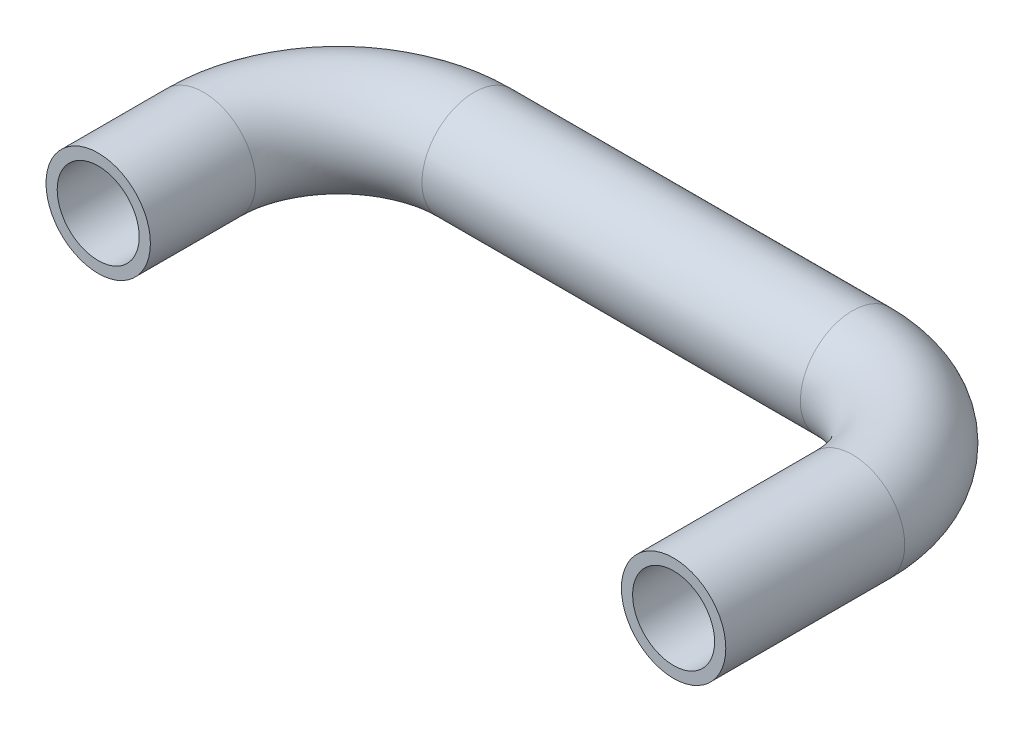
ISO-10303-21;
HEADER;
FILE_DESCRIPTION(('STEP AP214'),'2;1');
FILE_NAME('part.step','',(''),(''),'','','');
FILE_SCHEMA(('AUTOMOTIVE_DESIGN { 1 0 10303 214 1 1 1 1 }'));
ENDSEC;
DATA;
#1=APPLICATION_CONTEXT('core data for automotive mechanical design processes');
#2=APPLICATION_PROTOCOL_DEFINITION('international standard','automotive_design',2000,#1);
#3=PRODUCT_CONTEXT('',#1,'mechanical');
#4=PRODUCT('Part','Part','',(#3));
#5=PRODUCT_RELATED_PRODUCT_CATEGORY('part','',(#4));
#6=PRODUCT_DEFINITION_FORMATION('','',#4);
#7=PRODUCT_DEFINITION_CONTEXT('part definition',#1,'design');
#8=PRODUCT_DEFINITION('design','',#6,#7);
#9=PRODUCT_DEFINITION_SHAPE('','',#8);
#10=(LENGTH_UNIT() NAMED_UNIT(*) SI_UNIT(.MILLI.,.METRE.));
#11=(NAMED_UNIT(*) PLANE_ANGLE_UNIT() SI_UNIT($,.RADIAN.));
#12=(NAMED_UNIT(*) SI_UNIT($,.STERADIAN.) SOLID_ANGLE_UNIT());
#13=UNCERTAINTY_MEASURE_WITH_UNIT(LENGTH_MEASURE(1.E-05),#10,'distance_accuracy_value','');
#14=(GEOMETRIC_REPRESENTATION_CONTEXT(3) GLOBAL_UNCERTAINTY_ASSIGNED_CONTEXT((#13)) GLOBAL_UNIT_ASSIGNED_CONTEXT((#10,
#11,#12)) REPRESENTATION_CONTEXT('',''));
#15=CARTESIAN_POINT('',(0.,0.,0.));
#16=DIRECTION('',(0.,0.,1.));
#17=DIRECTION('',(1.,0.,0.));
#18=AXIS2_PLACEMENT_3D('',#15,#16,#17);
#19=CARTESIAN_POINT('',(0.,0.,0.));
#20=DIRECTION('',(0.,0.,1.));
#21=DIRECTION('',(1.,0.,0.));
#22=AXIS2_PLACEMENT_3D('',#19,#20,#21);
#23=PLANE('',#22);
#24=CARTESIAN_POINT('',(0.,0.,0.));
#25=DIRECTION('',(0.,0.,1.));
#26=DIRECTION('',(1.,0.,0.));
#27=AXIS2_PLACEMENT_3D('',#24,#25,#26);
#28=CIRCLE('',#27,11.);
#29=CARTESIAN_POINT('',(11.,0.,0.));
#30=VERTEX_POINT('',#29);
#31=EDGE_CURVE('E75',#30,#30,#28,.T.);
#32=ORIENTED_EDGE('',*,*,#31,.F.);
#33=EDGE_LOOP('',(#32));
#34=FACE_BOUND('',#33,.T.);
#35=CARTESIAN_POINT('',(0.,0.,0.));
#36=DIRECTION('',(0.,0.,1.));
#37=DIRECTION('',(1.,0.,0.));
#38=AXIS2_PLACEMENT_3D('',#35,#36,#37);
#39=CIRCLE('',#38,14.);
#40=CARTESIAN_POINT('',(14.,0.,0.));
#41=VERTEX_POINT('',#40);
#42=EDGE_CURVE('E66',#41,#41,#39,.T.);
#43=ORIENTED_EDGE('',*,*,#42,.T.);
#44=EDGE_LOOP('',(#43));
#45=FACE_BOUND('',#44,.T.);
#46=ADVANCED_FACE('F39',(#34,#45),#23,.T.);
#47=CARTESIAN_POINT('',(171.25,0.,16.9));
#48=DIRECTION('',(0.,0.,-1.));
#49=DIRECTION('',(-1.,0.,0.));
#50=AXIS2_PLACEMENT_3D('',#47,#48,#49);
#51=PLANE('',#50);
#52=CARTESIAN_POINT('',(171.25,0.,16.9));
#53=DIRECTION('',(0.,0.,-1.));
#54=DIRECTION('',(-1.,0.,0.));
#55=AXIS2_PLACEMENT_3D('',#52,#53,#54);
#56=CIRCLE('',#55,11.);
#57=CARTESIAN_POINT('',(160.25,0.,16.9));
#58=VERTEX_POINT('',#57);
#59=EDGE_CURVE('E70',#58,#58,#56,.T.);
#60=ORIENTED_EDGE('',*,*,#59,.T.);
#61=EDGE_LOOP('',(#60));
#62=FACE_BOUND('',#61,.T.);
#63=CARTESIAN_POINT('',(171.25,0.,16.9));
#64=DIRECTION('',(0.,0.,-1.));
#65=DIRECTION('',(-1.,0.,0.));
#66=AXIS2_PLACEMENT_3D('',#63,#64,#65);
#67=CIRCLE('',#66,14.);
#68=CARTESIAN_POINT('',(157.25,0.,16.9));
#69=VERTEX_POINT('',#68);
#70=EDGE_CURVE('E10',#69,#69,#67,.T.);
#71=ORIENTED_EDGE('',*,*,#70,.F.);
#72=EDGE_LOOP('',(#71));
#73=FACE_BOUND('',#72,.T.);
#74=ADVANCED_FACE('F106',(#62,#73),#51,.F.);
#75=CARTESIAN_POINT('',(0.,0.,0.));
#76=DIRECTION('',(0.,0.,-1.));
#77=DIRECTION('',(-1.,0.,0.));
#78=AXIS2_PLACEMENT_3D('',#75,#76,#77);
#79=CYLINDRICAL_SURFACE('',#78,14.);
#80=CARTESIAN_POINT('',(0.,0.,-28.25));
#81=DIRECTION('',(0.,0.,1.));
#82=DIRECTION('',(1.,0.,0.));
#83=AXIS2_PLACEMENT_3D('',#80,#81,#82);
#84=CIRCLE('',#83,14.);
#85=CARTESIAN_POINT('',(-14.,0.,-28.25));
#86=VERTEX_POINT('',#85);
#87=EDGE_CURVE('E62',#86,#86,#84,.T.);
#88=ORIENTED_EDGE('',*,*,#87,.T.);
#89=EDGE_LOOP('',(#88));
#90=FACE_BOUND('',#89,.T.);
#91=ORIENTED_EDGE('',*,*,#42,.F.);
#92=EDGE_LOOP('',(#91));
#93=FACE_BOUND('',#92,.T.);
#94=ADVANCED_FACE('F110',(#90,#93),#79,.T.);
#95=CARTESIAN_POINT('',(36.3,0.,-28.25));
#96=DIRECTION('',(0.,-1.,0.));
#97=DIRECTION('',(0.,0.,-1.));
#98=AXIS2_PLACEMENT_3D('',#95,#96,#97);
#99=TOROIDAL_SURFACE('',#98,36.3,14.);
#100=CARTESIAN_POINT('',(36.3,0.,-64.55));
#101=DIRECTION('',(-1.,0.,0.));
#102=DIRECTION('',(0.,0.,1.));
#103=AXIS2_PLACEMENT_3D('',#100,#101,#102);
#104=CIRCLE('',#103,14.);
#105=CARTESIAN_POINT('',(36.3,0.,-78.55));
#106=VERTEX_POINT('',#105);
#107=EDGE_CURVE('E56',#106,#106,#104,.T.);
#108=CARTESIAN_POINT('',(36.3,0.,-28.25));
#109=DIRECTION('',(0.,-1.,0.));
#110=DIRECTION('',(0.,0.,-1.));
#111=AXIS2_PLACEMENT_3D('',#108,#109,#110);
#112=CIRCLE('',#111,50.3);
#113=EDGE_CURVE('',#86,#106,#112,.T.);
#114=ORIENTED_EDGE('',*,*,#87,.F.);
#115=ORIENTED_EDGE('',*,*,#107,.T.);
#116=ORIENTED_EDGE('',*,*,#113,.T.);
#117=ORIENTED_EDGE('',*,*,#113,.F.);
#118=EDGE_LOOP('',(#114,#116,#115,#117));
#119=FACE_BOUND('',#118,.T.);
#120=ADVANCED_FACE('F112',(#119),#99,.T.);
#121=CARTESIAN_POINT('',(36.3,0.,-64.55));
#122=DIRECTION('',(1.,0.,0.));
#123=DIRECTION('',(0.,0.,-1.));
#124=AXIS2_PLACEMENT_3D('',#121,#122,#123);
#125=CYLINDRICAL_SURFACE('',#124,14.);
#126=CARTESIAN_POINT('',(137.8,0.,-64.55));
#127=DIRECTION('',(-1.,0.,0.));
#128=DIRECTION('',(0.,0.,1.));
#129=AXIS2_PLACEMENT_3D('',#126,#127,#128);
#130=CIRCLE('',#129,14.);
#131=CARTESIAN_POINT('',(137.8,0.,-78.55));
#132=VERTEX_POINT('',#131);
#133=EDGE_CURVE('E51',#132,#132,#130,.T.);
#134=ORIENTED_EDGE('',*,*,#133,.T.);
#135=EDGE_LOOP('',(#134));
#136=FACE_BOUND('',#135,.T.);
#137=ORIENTED_EDGE('',*,*,#107,.F.);
#138=EDGE_LOOP('',(#137));
#139=FACE_BOUND('',#138,.T.);
#140=ADVANCED_FACE('F119',(#136,#139),#125,.T.);
#141=CARTESIAN_POINT('',(137.8,0.,-31.1));
#142=DIRECTION('',(0.,-1.,0.));
#143=DIRECTION('',(0.,0.,-1.));
#144=AXIS2_PLACEMENT_3D('',#141,#142,#143);
#145=TOROIDAL_SURFACE('',#144,33.45,14.);
#146=CARTESIAN_POINT('',(171.25,0.,-31.1));
#147=DIRECTION('',(0.,0.,-1.));
#148=DIRECTION('',(-1.,0.,0.));
#149=AXIS2_PLACEMENT_3D('',#146,#147,#148);
#150=CIRCLE('',#149,14.);
#151=CARTESIAN_POINT('',(185.25,0.,-31.1));
#152=VERTEX_POINT('',#151);
#153=EDGE_CURVE('E46',#152,#152,#150,.T.);
#154=CARTESIAN_POINT('',(137.8,0.,-31.1));
#155=DIRECTION('',(0.,-1.,0.));
#156=DIRECTION('',(0.,0.,-1.));
#157=AXIS2_PLACEMENT_3D('',#154,#155,#156);
#158=CIRCLE('',#157,47.45);
#159=EDGE_CURVE('',#132,#152,#158,.T.);
#160=ORIENTED_EDGE('',*,*,#133,.F.);
#161=ORIENTED_EDGE('',*,*,#153,.T.);
#162=ORIENTED_EDGE('',*,*,#159,.T.);
#163=ORIENTED_EDGE('',*,*,#159,.F.);
#164=EDGE_LOOP('',(#160,#162,#161,#163));
#165=FACE_BOUND('',#164,.T.);
#166=ADVANCED_FACE('F125',(#165),#145,.T.);
#167=CARTESIAN_POINT('',(171.25,0.,-31.1));
#168=DIRECTION('',(0.,0.,1.));
#169=DIRECTION('',(1.,0.,0.));
#170=AXIS2_PLACEMENT_3D('',#167,#168,#169);
#171=CYLINDRICAL_SURFACE('',#170,14.);
#172=ORIENTED_EDGE('',*,*,#70,.T.);
#173=EDGE_LOOP('',(#172));
#174=FACE_BOUND('',#173,.T.);
#175=ORIENTED_EDGE('',*,*,#153,.F.);
#176=EDGE_LOOP('',(#175));
#177=FACE_BOUND('',#176,.T.);
#178=ADVANCED_FACE('F100',(#174,#177),#171,.T.);
#179=CARTESIAN_POINT('',(0.,0.,0.));
#180=DIRECTION('',(0.,0.,-1.));
#181=DIRECTION('',(-1.,0.,0.));
#182=AXIS2_PLACEMENT_3D('',#179,#180,#181);
#183=CYLINDRICAL_SURFACE('',#182,11.);
#184=CARTESIAN_POINT('',(0.,0.,-28.25));
#185=DIRECTION('',(0.,0.,-1.));
#186=DIRECTION('',(-1.,0.,0.));
#187=AXIS2_PLACEMENT_3D('',#184,#185,#186);
#188=CIRCLE('',#187,11.);
#189=CARTESIAN_POINT('',(-11.,0.,-28.25));
#190=VERTEX_POINT('',#189);
#191=EDGE_CURVE('E79',#190,#190,#188,.F.);
#192=ORIENTED_EDGE('',*,*,#191,.F.);
#193=EDGE_LOOP('',(#192));
#194=FACE_BOUND('',#193,.T.);
#195=ORIENTED_EDGE('',*,*,#31,.T.);
#196=EDGE_LOOP('',(#195));
#197=FACE_BOUND('',#196,.T.);
#198=ADVANCED_FACE('F97',(#194,#197),#183,.F.);
#199=CARTESIAN_POINT('',(36.3,0.,-28.25));
#200=DIRECTION('',(0.,-1.,0.));
#201=DIRECTION('',(0.,0.,-1.));
#202=AXIS2_PLACEMENT_3D('',#199,#200,#201);
#203=TOROIDAL_SURFACE('',#202,36.3,11.);
#204=CARTESIAN_POINT('',(36.3,0.,-64.55));
#205=DIRECTION('',(-1.,0.,0.));
#206=DIRECTION('',(0.,0.,1.));
#207=AXIS2_PLACEMENT_3D('',#204,#205,#206);
#208=CIRCLE('',#207,11.);
#209=CARTESIAN_POINT('',(36.3,0.,-75.55));
#210=VERTEX_POINT('',#209);
#211=EDGE_CURVE('E87',#210,#210,#208,.T.);
#212=CARTESIAN_POINT('',(36.3,0.,-28.25));
#213=DIRECTION('',(0.,-1.,0.));
#214=DIRECTION('',(0.,0.,-1.));
#215=AXIS2_PLACEMENT_3D('',#212,#213,#214);
#216=CIRCLE('',#215,47.3);
#217=EDGE_CURVE('',#190,#210,#216,.T.);
#218=ORIENTED_EDGE('',*,*,#191,.T.);
#219=ORIENTED_EDGE('',*,*,#211,.F.);
#220=ORIENTED_EDGE('',*,*,#217,.T.);
#221=ORIENTED_EDGE('',*,*,#217,.F.);
#222=EDGE_LOOP('',(#218,#220,#219,#221));
#223=FACE_BOUND('',#222,.T.);
#224=ADVANCED_FACE('F95',(#223),#203,.F.);
#225=CARTESIAN_POINT('',(36.3,0.,-64.55));
#226=DIRECTION('',(1.,0.,0.));
#227=DIRECTION('',(0.,0.,-1.));
#228=AXIS2_PLACEMENT_3D('',#225,#226,#227);
#229=CYLINDRICAL_SURFACE('',#228,11.);
#230=CARTESIAN_POINT('',(137.8,0.,-64.55));
#231=DIRECTION('',(1.,0.,0.));
#232=DIRECTION('',(0.,0.,-1.));
#233=AXIS2_PLACEMENT_3D('',#230,#231,#232);
#234=CIRCLE('',#233,11.);
#235=CARTESIAN_POINT('',(137.8,0.,-75.55));
#236=VERTEX_POINT('',#235);
#237=EDGE_CURVE('E83',#236,#236,#234,.F.);
#238=ORIENTED_EDGE('',*,*,#237,.F.);
#239=EDGE_LOOP('',(#238));
#240=FACE_BOUND('',#239,.T.);
#241=ORIENTED_EDGE('',*,*,#211,.T.);
#242=EDGE_LOOP('',(#241));
#243=FACE_BOUND('',#242,.T.);
#244=ADVANCED_FACE('F168',(#240,#243),#229,.F.);
#245=CARTESIAN_POINT('',(137.8,0.,-31.1));
#246=DIRECTION('',(0.,-1.,0.));
#247=DIRECTION('',(0.,0.,-1.));
#248=AXIS2_PLACEMENT_3D('',#245,#246,#247);
#249=TOROIDAL_SURFACE('',#248,33.45,11.);
#250=CARTESIAN_POINT('',(171.25,0.,-31.1));
#251=DIRECTION('',(0.,0.,-1.));
#252=DIRECTION('',(-1.,0.,0.));
#253=AXIS2_PLACEMENT_3D('',#250,#251,#252);
#254=CIRCLE('',#253,11.);
#255=CARTESIAN_POINT('',(182.25,0.,-31.1));
#256=VERTEX_POINT('',#255);
#257=EDGE_CURVE('E74',#256,#256,#254,.T.);
#258=CARTESIAN_POINT('',(137.8,0.,-31.1));
#259=DIRECTION('',(0.,-1.,0.));
#260=DIRECTION('',(0.,0.,-1.));
#261=AXIS2_PLACEMENT_3D('',#258,#259,#260);
#262=CIRCLE('',#261,44.45);
#263=EDGE_CURVE('',#236,#256,#262,.T.);
#264=ORIENTED_EDGE('',*,*,#237,.T.);
#265=ORIENTED_EDGE('',*,*,#257,.F.);
#266=ORIENTED_EDGE('',*,*,#263,.T.);
#267=ORIENTED_EDGE('',*,*,#263,.F.);
#268=EDGE_LOOP('',(#264,#266,#265,#267));
#269=FACE_BOUND('',#268,.T.);
#270=ADVANCED_FACE('F178',(#269),#249,.F.);
#271=CARTESIAN_POINT('',(171.25,0.,-31.1));
#272=DIRECTION('',(0.,0.,1.));
#273=DIRECTION('',(1.,0.,0.));
#274=AXIS2_PLACEMENT_3D('',#271,#272,#273);
#275=CYLINDRICAL_SURFACE('',#274,11.);
#276=ORIENTED_EDGE('',*,*,#59,.F.);
#277=EDGE_LOOP('',(#276));
#278=FACE_BOUND('',#277,.T.);
#279=ORIENTED_EDGE('',*,*,#257,.T.);
#280=EDGE_LOOP('',(#279));
#281=FACE_BOUND('',#280,.T.);
#282=ADVANCED_FACE('F107',(#278,#281),#275,.F.);
#283=CLOSED_SHELL('',(#46,#74,#94,#120,#140,#166,#178,#198,#224,#244,#270,#282));
#284=MANIFOLD_SOLID_BREP('B2',#283);
#285=ADVANCED_BREP_SHAPE_REPRESENTATION('',(#18,#284),#14);
#286=SHAPE_DEFINITION_REPRESENTATION(#9,#285);
ENDSEC;
END-ISO-10303-21;
